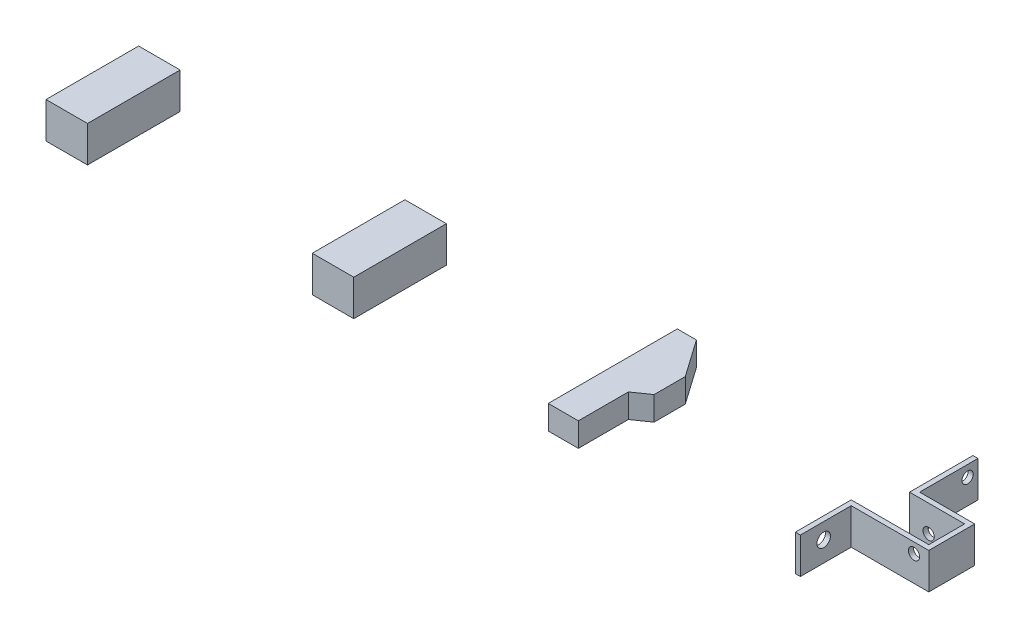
ISO-10303-21;
HEADER;
FILE_DESCRIPTION(('STEP AP214'),'2;1');
FILE_NAME('part.step','',(''),(''),'','','');
FILE_SCHEMA(('AUTOMOTIVE_DESIGN { 1 0 10303 214 1 1 1 1 }'));
ENDSEC;
DATA;
#1=APPLICATION_CONTEXT('core data for automotive mechanical design processes');
#2=APPLICATION_PROTOCOL_DEFINITION('international standard','automotive_design',2000,#1);
#3=PRODUCT_CONTEXT('',#1,'mechanical');
#4=PRODUCT('Part','Part','',(#3));
#5=PRODUCT_RELATED_PRODUCT_CATEGORY('part','',(#4));
#6=PRODUCT_DEFINITION_FORMATION('','',#4);
#7=PRODUCT_DEFINITION_CONTEXT('part definition',#1,'design');
#8=PRODUCT_DEFINITION('design','',#6,#7);
#9=PRODUCT_DEFINITION_SHAPE('','',#8);
#10=(LENGTH_UNIT() NAMED_UNIT(*) SI_UNIT(.MILLI.,.METRE.));
#11=(NAMED_UNIT(*) PLANE_ANGLE_UNIT() SI_UNIT($,.RADIAN.));
#12=(NAMED_UNIT(*) SI_UNIT($,.STERADIAN.) SOLID_ANGLE_UNIT());
#13=UNCERTAINTY_MEASURE_WITH_UNIT(LENGTH_MEASURE(1.E-05),#10,'distance_accuracy_value','');
#14=(GEOMETRIC_REPRESENTATION_CONTEXT(3) GLOBAL_UNCERTAINTY_ASSIGNED_CONTEXT((#13)) GLOBAL_UNIT_ASSIGNED_CONTEXT((#10,
#11,#12)) REPRESENTATION_CONTEXT('',''));
#15=CARTESIAN_POINT('',(0.,0.,0.));
#16=DIRECTION('',(0.,0.,1.));
#17=DIRECTION('',(1.,0.,0.));
#18=AXIS2_PLACEMENT_3D('',#15,#16,#17);
#19=CARTESIAN_POINT('',(2807.43276867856,90.932,-231.918070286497));
#20=DIRECTION('',(-1.,0.,0.));
#21=DIRECTION('',(0.,0.,1.));
#22=AXIS2_PLACEMENT_3D('',#19,#20,#21);
#23=PLANE('',#22);
#24=CARTESIAN_POINT('',(2807.43276867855,62.3904977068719,-365.992045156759));
#25=DIRECTION('',(1.,0.,0.));
#26=DIRECTION('',(0.,0.,-1.));
#27=AXIS2_PLACEMENT_3D('',#24,#25,#26);
#28=CIRCLE('',#27,14.2659387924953);
#29=CARTESIAN_POINT('',(2807.43276867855,62.3904977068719,-380.257983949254));
#30=VERTEX_POINT('',#29);
#31=EDGE_CURVE('E280',#30,#30,#28,.T.);
#32=ORIENTED_EDGE('',*,*,#31,.F.);
#33=EDGE_LOOP('',(#32));
#34=FACE_BOUND('',#33,.T.);
#35=DIRECTION('',(0.,0.,-1.));
#36=VECTOR('',#35,1.);
#37=CARTESIAN_POINT('',(2807.43276867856,0.,-231.918070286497));
#38=LINE('',#37,#36);
#39=CARTESIAN_POINT('',(2807.43276867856,0.,-244.618070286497));
#40=VERTEX_POINT('',#39);
#41=CARTESIAN_POINT('',(2807.43276867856,0.,-392.203098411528));
#42=VERTEX_POINT('',#41);
#43=EDGE_CURVE('E140',#40,#42,#38,.T.);
#44=ORIENTED_EDGE('',*,*,#43,.T.);
#45=DIRECTION('',(0.,-1.,0.));
#46=VECTOR('',#45,1.);
#47=CARTESIAN_POINT('',(2807.43276867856,90.932,-392.203098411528));
#48=LINE('',#47,#46);
#49=CARTESIAN_POINT('',(2807.43276867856,90.932,-392.203098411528));
#50=VERTEX_POINT('',#49);
#51=EDGE_CURVE('E12',#50,#42,#48,.T.);
#52=ORIENTED_EDGE('',*,*,#51,.F.);
#53=DIRECTION('',(0.,0.,-1.));
#54=VECTOR('',#53,1.);
#55=CARTESIAN_POINT('',(2807.43276867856,90.932,-231.918070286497));
#56=LINE('',#55,#54);
#57=CARTESIAN_POINT('',(2807.43276867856,90.932,-244.618070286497));
#58=VERTEX_POINT('',#57);
#59=EDGE_CURVE('E176',#58,#50,#56,.T.);
#60=ORIENTED_EDGE('',*,*,#59,.F.);
#61=DIRECTION('',(0.,-1.,0.));
#62=VECTOR('',#61,1.);
#63=CARTESIAN_POINT('',(2807.43276867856,90.932,-244.618070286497));
#64=LINE('',#63,#62);
#65=EDGE_CURVE('E141',#58,#40,#64,.T.);
#66=ORIENTED_EDGE('',*,*,#65,.T.);
#67=EDGE_LOOP('',(#44,#52,#60,#66));
#68=FACE_BOUND('',#67,.T.);
#69=ADVANCED_FACE('F42',(#34,#68),#23,.F.);
#70=CARTESIAN_POINT('',(2794.73276867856,90.932,-392.203098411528));
#71=DIRECTION('',(0.,0.,-1.));
#72=DIRECTION('',(-1.,0.,0.));
#73=AXIS2_PLACEMENT_3D('',#70,#71,#72);
#74=PLANE('',#73);
#75=DIRECTION('',(1.,0.,0.));
#76=VECTOR('',#75,1.);
#77=CARTESIAN_POINT('',(2794.73276867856,0.,-392.203098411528));
#78=LINE('',#77,#76);
#79=CARTESIAN_POINT('',(2794.73276867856,0.,-392.203098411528));
#80=VERTEX_POINT('',#79);
#81=EDGE_CURVE('E132',#80,#42,#78,.T.);
#82=ORIENTED_EDGE('',*,*,#81,.F.);
#83=DIRECTION('',(0.,-1.,0.));
#84=VECTOR('',#83,1.);
#85=CARTESIAN_POINT('',(2794.73276867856,90.932,-392.203098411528));
#86=LINE('',#85,#84);
#87=CARTESIAN_POINT('',(2794.73276867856,90.932,-392.203098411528));
#88=VERTEX_POINT('',#87);
#89=EDGE_CURVE('E49',#88,#80,#86,.T.);
#90=ORIENTED_EDGE('',*,*,#89,.F.);
#91=DIRECTION('',(1.,0.,0.));
#92=VECTOR('',#91,1.);
#93=CARTESIAN_POINT('',(2794.73276867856,90.932,-392.203098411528));
#94=LINE('',#93,#92);
#95=EDGE_CURVE('E135',#88,#50,#94,.T.);
#96=ORIENTED_EDGE('',*,*,#95,.T.);
#97=ORIENTED_EDGE('',*,*,#51,.T.);
#98=EDGE_LOOP('',(#82,#90,#96,#97));
#99=FACE_BOUND('',#98,.T.);
#100=ADVANCED_FACE('F130',(#99),#74,.T.);
#101=CARTESIAN_POINT('',(2794.73276867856,90.932,-231.918070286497));
#102=DIRECTION('',(-1.,0.,0.));
#103=DIRECTION('',(0.,0.,1.));
#104=AXIS2_PLACEMENT_3D('',#101,#102,#103);
#105=PLANE('',#104);
#106=CARTESIAN_POINT('',(2794.73276867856,62.3904977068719,-365.992045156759));
#107=DIRECTION('',(-1.,0.,0.));
#108=DIRECTION('',(0.,0.,1.));
#109=AXIS2_PLACEMENT_3D('',#106,#107,#108);
#110=CIRCLE('',#109,14.2659387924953);
#111=CARTESIAN_POINT('',(2794.73276867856,62.3904977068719,-351.726106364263));
#112=VERTEX_POINT('',#111);
#113=EDGE_CURVE('E283',#112,#112,#110,.F.);
#114=ORIENTED_EDGE('',*,*,#113,.T.);
#115=EDGE_LOOP('',(#114));
#116=FACE_BOUND('',#115,.T.);
#117=DIRECTION('',(0.,0.,-1.));
#118=VECTOR('',#117,1.);
#119=CARTESIAN_POINT('',(2794.73276867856,0.,-231.918070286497));
#120=LINE('',#119,#118);
#121=CARTESIAN_POINT('',(2794.73276867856,0.,-231.918070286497));
#122=VERTEX_POINT('',#121);
#123=EDGE_CURVE('E149',#122,#80,#120,.T.);
#124=ORIENTED_EDGE('',*,*,#123,.F.);
#125=DIRECTION('',(0.,-1.,0.));
#126=VECTOR('',#125,1.);
#127=CARTESIAN_POINT('',(2794.73276867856,90.932,-231.918070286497));
#128=LINE('',#127,#126);
#129=CARTESIAN_POINT('',(2794.73276867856,90.932,-231.918070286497));
#130=VERTEX_POINT('',#129);
#131=EDGE_CURVE('E223',#130,#122,#128,.T.);
#132=ORIENTED_EDGE('',*,*,#131,.F.);
#133=DIRECTION('',(0.,0.,-1.));
#134=VECTOR('',#133,1.);
#135=CARTESIAN_POINT('',(2794.73276867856,90.932,-231.918070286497));
#136=LINE('',#135,#134);
#137=EDGE_CURVE('E179',#130,#88,#136,.T.);
#138=ORIENTED_EDGE('',*,*,#137,.T.);
#139=ORIENTED_EDGE('',*,*,#89,.T.);
#140=EDGE_LOOP('',(#124,#132,#138,#139));
#141=FACE_BOUND('',#140,.T.);
#142=ADVANCED_FACE('F225',(#116,#141),#105,.T.);
#143=CARTESIAN_POINT('',(2933.94283778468,90.932,-231.918070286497));
#144=DIRECTION('',(0.,0.,1.));
#145=DIRECTION('',(1.,0.,0.));
#146=AXIS2_PLACEMENT_3D('',#143,#144,#145);
#147=PLANE('',#146);
#148=CARTESIAN_POINT('',(2842.96255362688,23.9493750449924,-231.918070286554));
#149=DIRECTION('',(0.,0.,1.));
#150=DIRECTION('',(1.,0.,0.));
#151=AXIS2_PLACEMENT_3D('',#148,#149,#150);
#152=CIRCLE('',#151,14.2659387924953);
#153=CARTESIAN_POINT('',(2857.22849241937,23.9493750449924,-231.918070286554));
#154=VERTEX_POINT('',#153);
#155=EDGE_CURVE('E282',#154,#154,#152,.T.);
#156=ORIENTED_EDGE('',*,*,#155,.F.);
#157=EDGE_LOOP('',(#156));
#158=FACE_BOUND('',#157,.T.);
#159=DIRECTION('',(-1.,0.,0.));
#160=VECTOR('',#159,1.);
#161=CARTESIAN_POINT('',(2933.94283778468,0.,-231.918070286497));
#162=LINE('',#161,#160);
#163=CARTESIAN_POINT('',(2933.94283778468,0.,-231.918070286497));
#164=VERTEX_POINT('',#163);
#165=EDGE_CURVE('E151',#164,#122,#162,.T.);
#166=ORIENTED_EDGE('',*,*,#165,.F.);
#167=DIRECTION('',(0.,-1.,0.));
#168=VECTOR('',#167,1.);
#169=CARTESIAN_POINT('',(2933.94283778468,90.932,-231.918070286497));
#170=LINE('',#169,#168);
#171=CARTESIAN_POINT('',(2933.94283778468,90.932,-231.918070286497));
#172=VERTEX_POINT('',#171);
#173=EDGE_CURVE('E221',#172,#164,#170,.T.);
#174=ORIENTED_EDGE('',*,*,#173,.F.);
#175=DIRECTION('',(-1.,0.,0.));
#176=VECTOR('',#175,1.);
#177=CARTESIAN_POINT('',(2933.94283778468,90.932,-231.918070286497));
#178=LINE('',#177,#176);
#179=EDGE_CURVE('E182',#172,#130,#178,.T.);
#180=ORIENTED_EDGE('',*,*,#179,.T.);
#181=ORIENTED_EDGE('',*,*,#131,.T.);
#182=EDGE_LOOP('',(#166,#174,#180,#181));
#183=FACE_BOUND('',#182,.T.);
#184=ADVANCED_FACE('F232',(#158,#183),#147,.T.);
#185=CARTESIAN_POINT('',(2933.94283778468,90.932,-141.242708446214));
#186=DIRECTION('',(-1.,0.,0.));
#187=DIRECTION('',(0.,0.,1.));
#188=AXIS2_PLACEMENT_3D('',#185,#186,#187);
#189=PLANE('',#188);
#190=DIRECTION('',(0.,0.,-1.));
#191=VECTOR('',#190,1.);
#192=CARTESIAN_POINT('',(2933.94283778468,0.,-141.242708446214));
#193=LINE('',#192,#191);
#194=CARTESIAN_POINT('',(2933.94283778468,0.,-141.242708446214));
#195=VERTEX_POINT('',#194);
#196=EDGE_CURVE('E156',#195,#164,#193,.T.);
#197=ORIENTED_EDGE('',*,*,#196,.F.);
#198=DIRECTION('',(0.,-1.,0.));
#199=VECTOR('',#198,1.);
#200=CARTESIAN_POINT('',(2933.94283778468,90.932,-141.242708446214));
#201=LINE('',#200,#199);
#202=CARTESIAN_POINT('',(2933.94283778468,90.932,-141.242708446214));
#203=VERTEX_POINT('',#202);
#204=EDGE_CURVE('E219',#203,#195,#201,.T.);
#205=ORIENTED_EDGE('',*,*,#204,.F.);
#206=DIRECTION('',(0.,0.,-1.));
#207=VECTOR('',#206,1.);
#208=CARTESIAN_POINT('',(2933.94283778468,90.932,-141.242708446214));
#209=LINE('',#208,#207);
#210=EDGE_CURVE('E185',#203,#172,#209,.T.);
#211=ORIENTED_EDGE('',*,*,#210,.T.);
#212=ORIENTED_EDGE('',*,*,#173,.T.);
#213=EDGE_LOOP('',(#197,#205,#211,#212));
#214=FACE_BOUND('',#213,.T.);
#215=ADVANCED_FACE('F235',(#214),#189,.T.);
#216=CARTESIAN_POINT('',(2737.90789771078,90.932,-141.242708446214));
#217=DIRECTION('',(0.,0.,-1.));
#218=DIRECTION('',(-1.,0.,0.));
#219=AXIS2_PLACEMENT_3D('',#216,#217,#218);
#220=PLANE('',#219);
#221=CARTESIAN_POINT('',(2909.26893038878,65.0381850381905,-141.242708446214));
#222=DIRECTION('',(0.,0.,-1.));
#223=DIRECTION('',(-1.,0.,0.));
#224=AXIS2_PLACEMENT_3D('',#221,#222,#223);
#225=CIRCLE('',#224,14.2659387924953);
#226=CARTESIAN_POINT('',(2895.00299159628,65.0381850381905,-141.242708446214));
#227=VERTEX_POINT('',#226);
#228=EDGE_CURVE('E293',#227,#227,#225,.F.);
#229=ORIENTED_EDGE('',*,*,#228,.T.);
#230=EDGE_LOOP('',(#229));
#231=FACE_BOUND('',#230,.T.);
#232=DIRECTION('',(1.,0.,0.));
#233=VECTOR('',#232,1.);
#234=CARTESIAN_POINT('',(2737.90789771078,0.,-141.242708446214));
#235=LINE('',#234,#233);
#236=CARTESIAN_POINT('',(2737.90789771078,0.,-141.242708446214));
#237=VERTEX_POINT('',#236);
#238=EDGE_CURVE('E159',#237,#195,#235,.T.);
#239=ORIENTED_EDGE('',*,*,#238,.F.);
#240=DIRECTION('',(0.,-1.,0.));
#241=VECTOR('',#240,1.);
#242=CARTESIAN_POINT('',(2737.90789771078,90.932,-141.242708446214));
#243=LINE('',#242,#241);
#244=CARTESIAN_POINT('',(2737.90789771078,90.932,-141.242708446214));
#245=VERTEX_POINT('',#244);
#246=EDGE_CURVE('E217',#245,#237,#243,.T.);
#247=ORIENTED_EDGE('',*,*,#246,.F.);
#248=DIRECTION('',(1.,0.,0.));
#249=VECTOR('',#248,1.);
#250=CARTESIAN_POINT('',(2737.90789771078,90.932,-141.242708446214));
#251=LINE('',#250,#249);
#252=EDGE_CURVE('E188',#245,#203,#251,.T.);
#253=ORIENTED_EDGE('',*,*,#252,.T.);
#254=ORIENTED_EDGE('',*,*,#204,.T.);
#255=EDGE_LOOP('',(#239,#247,#253,#254));
#256=FACE_BOUND('',#255,.T.);
#257=ADVANCED_FACE('F240',(#231,#256),#220,.T.);
#258=CARTESIAN_POINT('',(2737.90789771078,90.932,0.));
#259=DIRECTION('',(-1.,0.,0.));
#260=DIRECTION('',(0.,0.,1.));
#261=AXIS2_PLACEMENT_3D('',#258,#259,#260);
#262=PLANE('',#261);
#263=CARTESIAN_POINT('',(2737.90789771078,50.87769285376,-58.9251392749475));
#264=DIRECTION('',(-1.,0.,0.));
#265=DIRECTION('',(0.,0.,1.));
#266=AXIS2_PLACEMENT_3D('',#263,#264,#265);
#267=CIRCLE('',#266,17.1517403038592);
#268=CARTESIAN_POINT('',(2737.90789771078,50.87769285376,-41.7733989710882));
#269=VERTEX_POINT('',#268);
#270=EDGE_CURVE('E299',#269,#269,#267,.F.);
#271=ORIENTED_EDGE('',*,*,#270,.T.);
#272=EDGE_LOOP('',(#271));
#273=FACE_BOUND('',#272,.T.);
#274=DIRECTION('',(0.,0.,-1.));
#275=VECTOR('',#274,1.);
#276=CARTESIAN_POINT('',(2737.90789771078,0.,0.));
#277=LINE('',#276,#275);
#278=CARTESIAN_POINT('',(2737.90789771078,0.,0.));
#279=VERTEX_POINT('',#278);
#280=EDGE_CURVE('E162',#279,#237,#277,.T.);
#281=ORIENTED_EDGE('',*,*,#280,.F.);
#282=DIRECTION('',(0.,-1.,0.));
#283=VECTOR('',#282,1.);
#284=CARTESIAN_POINT('',(2737.90789771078,90.932,0.));
#285=LINE('',#284,#283);
#286=CARTESIAN_POINT('',(2737.90789771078,90.932,0.));
#287=VERTEX_POINT('',#286);
#288=EDGE_CURVE('E215',#287,#279,#285,.T.);
#289=ORIENTED_EDGE('',*,*,#288,.F.);
#290=DIRECTION('',(0.,0.,-1.));
#291=VECTOR('',#290,1.);
#292=CARTESIAN_POINT('',(2737.90789771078,90.932,0.));
#293=LINE('',#292,#291);
#294=EDGE_CURVE('E191',#287,#245,#293,.T.);
#295=ORIENTED_EDGE('',*,*,#294,.T.);
#296=ORIENTED_EDGE('',*,*,#246,.T.);
#297=EDGE_LOOP('',(#281,#289,#295,#296));
#298=FACE_BOUND('',#297,.T.);
#299=ADVANCED_FACE('F243',(#273,#298),#262,.T.);
#300=CARTESIAN_POINT('',(2750.60789771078,90.932,0.));
#301=DIRECTION('',(0.,0.,1.));
#302=DIRECTION('',(1.,0.,0.));
#303=AXIS2_PLACEMENT_3D('',#300,#301,#302);
#304=PLANE('',#303);
#305=DIRECTION('',(-1.,0.,0.));
#306=VECTOR('',#305,1.);
#307=CARTESIAN_POINT('',(2750.60789771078,0.,0.));
#308=LINE('',#307,#306);
#309=CARTESIAN_POINT('',(2750.60789771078,0.,0.));
#310=VERTEX_POINT('',#309);
#311=EDGE_CURVE('E165',#310,#279,#308,.T.);
#312=ORIENTED_EDGE('',*,*,#311,.F.);
#313=DIRECTION('',(0.,-1.,0.));
#314=VECTOR('',#313,1.);
#315=CARTESIAN_POINT('',(2750.60789771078,90.932,0.));
#316=LINE('',#315,#314);
#317=CARTESIAN_POINT('',(2750.60789771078,90.932,0.));
#318=VERTEX_POINT('',#317);
#319=EDGE_CURVE('E213',#318,#310,#316,.T.);
#320=ORIENTED_EDGE('',*,*,#319,.F.);
#321=DIRECTION('',(-1.,0.,0.));
#322=VECTOR('',#321,1.);
#323=CARTESIAN_POINT('',(2750.60789771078,90.932,0.));
#324=LINE('',#323,#322);
#325=EDGE_CURVE('E194',#318,#287,#324,.T.);
#326=ORIENTED_EDGE('',*,*,#325,.T.);
#327=ORIENTED_EDGE('',*,*,#288,.T.);
#328=EDGE_LOOP('',(#312,#320,#326,#327));
#329=FACE_BOUND('',#328,.T.);
#330=ADVANCED_FACE('F247',(#329),#304,.T.);
#331=CARTESIAN_POINT('',(2750.60789771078,90.932,0.));
#332=DIRECTION('',(-1.,0.,0.));
#333=DIRECTION('',(0.,0.,1.));
#334=AXIS2_PLACEMENT_3D('',#331,#332,#333);
#335=PLANE('',#334);
#336=CARTESIAN_POINT('',(2750.60789771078,50.87769285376,-58.9251392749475));
#337=DIRECTION('',(1.,0.,0.));
#338=DIRECTION('',(0.,0.,-1.));
#339=AXIS2_PLACEMENT_3D('',#336,#337,#338);
#340=CIRCLE('',#339,17.1517403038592);
#341=CARTESIAN_POINT('',(2750.60789771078,50.87769285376,-76.0768795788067));
#342=VERTEX_POINT('',#341);
#343=EDGE_CURVE('E144',#342,#342,#340,.T.);
#344=ORIENTED_EDGE('',*,*,#343,.F.);
#345=EDGE_LOOP('',(#344));
#346=FACE_BOUND('',#345,.T.);
#347=DIRECTION('',(0.,0.,-1.));
#348=VECTOR('',#347,1.);
#349=CARTESIAN_POINT('',(2750.60789771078,0.,0.));
#350=LINE('',#349,#348);
#351=CARTESIAN_POINT('',(2750.60789771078,0.,-128.542708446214));
#352=VERTEX_POINT('',#351);
#353=EDGE_CURVE('E168',#310,#352,#350,.T.);
#354=ORIENTED_EDGE('',*,*,#353,.T.);
#355=DIRECTION('',(0.,-1.,0.));
#356=VECTOR('',#355,1.);
#357=CARTESIAN_POINT('',(2750.60789771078,90.932,-128.542708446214));
#358=LINE('',#357,#356);
#359=CARTESIAN_POINT('',(2750.60789771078,90.932,-128.542708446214));
#360=VERTEX_POINT('',#359);
#361=EDGE_CURVE('E210',#360,#352,#358,.T.);
#362=ORIENTED_EDGE('',*,*,#361,.F.);
#363=DIRECTION('',(0.,0.,-1.));
#364=VECTOR('',#363,1.);
#365=CARTESIAN_POINT('',(2750.60789771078,90.932,0.));
#366=LINE('',#365,#364);
#367=EDGE_CURVE('E197',#318,#360,#366,.T.);
#368=ORIENTED_EDGE('',*,*,#367,.F.);
#369=ORIENTED_EDGE('',*,*,#319,.T.);
#370=EDGE_LOOP('',(#354,#362,#368,#369));
#371=FACE_BOUND('',#370,.T.);
#372=ADVANCED_FACE('F252',(#346,#371),#335,.F.);
#373=CARTESIAN_POINT('',(2737.90789771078,90.932,-128.542708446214));
#374=DIRECTION('',(0.,0.,-1.));
#375=DIRECTION('',(-1.,0.,0.));
#376=AXIS2_PLACEMENT_3D('',#373,#374,#375);
#377=PLANE('',#376);
#378=CARTESIAN_POINT('',(2909.26893038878,65.0381850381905,-128.542708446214));
#379=DIRECTION('',(0.,0.,1.));
#380=DIRECTION('',(1.,0.,0.));
#381=AXIS2_PLACEMENT_3D('',#378,#379,#380);
#382=CIRCLE('',#381,14.2659387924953);
#383=CARTESIAN_POINT('',(2923.53486918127,65.0381850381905,-128.542708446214));
#384=VERTEX_POINT('',#383);
#385=EDGE_CURVE('E296',#384,#384,#382,.T.);
#386=ORIENTED_EDGE('',*,*,#385,.F.);
#387=EDGE_LOOP('',(#386));
#388=FACE_BOUND('',#387,.T.);
#389=DIRECTION('',(1.,0.,0.));
#390=VECTOR('',#389,1.);
#391=CARTESIAN_POINT('',(2737.90789771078,0.,-128.542708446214));
#392=LINE('',#391,#390);
#393=CARTESIAN_POINT('',(2946.64283778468,0.,-128.542708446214));
#394=VERTEX_POINT('',#393);
#395=EDGE_CURVE('E170',#352,#394,#392,.T.);
#396=ORIENTED_EDGE('',*,*,#395,.T.);
#397=DIRECTION('',(0.,-1.,0.));
#398=VECTOR('',#397,1.);
#399=CARTESIAN_POINT('',(2946.64283778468,90.932,-128.542708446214));
#400=LINE('',#399,#398);
#401=CARTESIAN_POINT('',(2946.64283778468,90.932,-128.542708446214));
#402=VERTEX_POINT('',#401);
#403=EDGE_CURVE('E207',#402,#394,#400,.T.);
#404=ORIENTED_EDGE('',*,*,#403,.F.);
#405=DIRECTION('',(1.,0.,0.));
#406=VECTOR('',#405,1.);
#407=CARTESIAN_POINT('',(2737.90789771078,90.932,-128.542708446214));
#408=LINE('',#407,#406);
#409=EDGE_CURVE('E199',#360,#402,#408,.T.);
#410=ORIENTED_EDGE('',*,*,#409,.F.);
#411=ORIENTED_EDGE('',*,*,#361,.T.);
#412=EDGE_LOOP('',(#396,#404,#410,#411));
#413=FACE_BOUND('',#412,.T.);
#414=ADVANCED_FACE('F256',(#388,#413),#377,.F.);
#415=CARTESIAN_POINT('',(2946.64283778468,90.932,-141.242708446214));
#416=DIRECTION('',(-1.,0.,0.));
#417=DIRECTION('',(0.,0.,1.));
#418=AXIS2_PLACEMENT_3D('',#415,#416,#417);
#419=PLANE('',#418);
#420=DIRECTION('',(0.,0.,-1.));
#421=VECTOR('',#420,1.);
#422=CARTESIAN_POINT('',(2946.64283778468,0.,-141.242708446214));
#423=LINE('',#422,#421);
#424=CARTESIAN_POINT('',(2946.64283778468,0.,-244.618070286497));
#425=VERTEX_POINT('',#424);
#426=EDGE_CURVE('E172',#394,#425,#423,.T.);
#427=ORIENTED_EDGE('',*,*,#426,.T.);
#428=DIRECTION('',(0.,-1.,0.));
#429=VECTOR('',#428,1.);
#430=CARTESIAN_POINT('',(2946.64283778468,90.932,-244.618070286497));
#431=LINE('',#430,#429);
#432=CARTESIAN_POINT('',(2946.64283778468,90.932,-244.618070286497));
#433=VERTEX_POINT('',#432);
#434=EDGE_CURVE('E204',#433,#425,#431,.T.);
#435=ORIENTED_EDGE('',*,*,#434,.F.);
#436=DIRECTION('',(0.,0.,-1.));
#437=VECTOR('',#436,1.);
#438=CARTESIAN_POINT('',(2946.64283778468,90.932,-141.242708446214));
#439=LINE('',#438,#437);
#440=EDGE_CURVE('E61',#402,#433,#439,.T.);
#441=ORIENTED_EDGE('',*,*,#440,.F.);
#442=ORIENTED_EDGE('',*,*,#403,.T.);
#443=EDGE_LOOP('',(#427,#435,#441,#442));
#444=FACE_BOUND('',#443,.T.);
#445=ADVANCED_FACE('F260',(#444),#419,.F.);
#446=CARTESIAN_POINT('',(2933.94283778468,90.932,-244.618070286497));
#447=DIRECTION('',(0.,0.,1.));
#448=DIRECTION('',(1.,0.,0.));
#449=AXIS2_PLACEMENT_3D('',#446,#447,#448);
#450=PLANE('',#449);
#451=CARTESIAN_POINT('',(2842.96255362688,23.9493750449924,-244.618070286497));
#452=DIRECTION('',(0.,0.,1.));
#453=DIRECTION('',(1.,0.,0.));
#454=AXIS2_PLACEMENT_3D('',#451,#452,#453);
#455=CIRCLE('',#454,14.2659387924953);
#456=CARTESIAN_POINT('',(2857.22849241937,23.9493750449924,-244.618070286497));
#457=VERTEX_POINT('',#456);
#458=EDGE_CURVE('E286',#457,#457,#455,.F.);
#459=ORIENTED_EDGE('',*,*,#458,.F.);
#460=EDGE_LOOP('',(#459));
#461=FACE_BOUND('',#460,.T.);
#462=DIRECTION('',(1.,0.,0.));
#463=VECTOR('',#462,1.);
#464=CARTESIAN_POINT('',(2933.94283778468,0.,-244.618070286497));
#465=LINE('',#464,#463);
#466=EDGE_CURVE('E174',#425,#40,#465,.F.);
#467=ORIENTED_EDGE('',*,*,#466,.T.);
#468=ORIENTED_EDGE('',*,*,#65,.F.);
#469=DIRECTION('',(1.,0.,0.));
#470=VECTOR('',#469,1.);
#471=CARTESIAN_POINT('',(2933.94283778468,90.932,-244.618070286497));
#472=LINE('',#471,#470);
#473=EDGE_CURVE('E56',#433,#58,#472,.F.);
#474=ORIENTED_EDGE('',*,*,#473,.F.);
#475=ORIENTED_EDGE('',*,*,#434,.T.);
#476=EDGE_LOOP('',(#467,#468,#474,#475));
#477=FACE_BOUND('',#476,.T.);
#478=ADVANCED_FACE('F262',(#461,#477),#450,.F.);
#479=CARTESIAN_POINT('',(2807.43276867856,90.932,-392.203098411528));
#480=DIRECTION('',(0.,-1.,0.));
#481=DIRECTION('',(0.,0.,-1.));
#482=AXIS2_PLACEMENT_3D('',#479,#480,#481);
#483=PLANE('',#482);
#484=ORIENTED_EDGE('',*,*,#59,.T.);
#485=ORIENTED_EDGE('',*,*,#95,.F.);
#486=ORIENTED_EDGE('',*,*,#137,.F.);
#487=ORIENTED_EDGE('',*,*,#179,.F.);
#488=ORIENTED_EDGE('',*,*,#210,.F.);
#489=ORIENTED_EDGE('',*,*,#252,.F.);
#490=ORIENTED_EDGE('',*,*,#294,.F.);
#491=ORIENTED_EDGE('',*,*,#325,.F.);
#492=ORIENTED_EDGE('',*,*,#367,.T.);
#493=ORIENTED_EDGE('',*,*,#409,.T.);
#494=ORIENTED_EDGE('',*,*,#440,.T.);
#495=ORIENTED_EDGE('',*,*,#473,.T.);
#496=EDGE_LOOP('',(#484,#485,#486,#487,#488,#489,#490,#491,#492,#493,#494,#495));
#497=FACE_BOUND('',#496,.T.);
#498=ADVANCED_FACE('F227',(#497),#483,.F.);
#499=CARTESIAN_POINT('',(2807.43276867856,0.,-392.203098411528));
#500=DIRECTION('',(0.,-1.,0.));
#501=DIRECTION('',(0.,0.,-1.));
#502=AXIS2_PLACEMENT_3D('',#499,#500,#501);
#503=PLANE('',#502);
#504=ORIENTED_EDGE('',*,*,#43,.F.);
#505=ORIENTED_EDGE('',*,*,#466,.F.);
#506=ORIENTED_EDGE('',*,*,#426,.F.);
#507=ORIENTED_EDGE('',*,*,#395,.F.);
#508=ORIENTED_EDGE('',*,*,#353,.F.);
#509=ORIENTED_EDGE('',*,*,#311,.T.);
#510=ORIENTED_EDGE('',*,*,#280,.T.);
#511=ORIENTED_EDGE('',*,*,#238,.T.);
#512=ORIENTED_EDGE('',*,*,#196,.T.);
#513=ORIENTED_EDGE('',*,*,#165,.T.);
#514=ORIENTED_EDGE('',*,*,#123,.T.);
#515=ORIENTED_EDGE('',*,*,#81,.T.);
#516=EDGE_LOOP('',(#504,#505,#506,#507,#508,#509,#510,#511,#512,#513,#514,#515));
#517=FACE_BOUND('',#516,.T.);
#518=ADVANCED_FACE('F146',(#517),#503,.T.);
#519=CARTESIAN_POINT('',(843.962027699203,50.87769285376,-58.9251392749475));
#520=DIRECTION('',(1.,0.,0.));
#521=DIRECTION('',(0.,0.,-1.));
#522=AXIS2_PLACEMENT_3D('',#519,#520,#521);
#523=CYLINDRICAL_SURFACE('',#522,17.1517403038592);
#524=ORIENTED_EDGE('',*,*,#270,.F.);
#525=EDGE_LOOP('',(#524));
#526=FACE_BOUND('',#525,.T.);
#527=ORIENTED_EDGE('',*,*,#343,.T.);
#528=EDGE_LOOP('',(#527));
#529=FACE_BOUND('',#528,.T.);
#530=ADVANCED_FACE('F305',(#526,#529),#523,.F.);
#531=CARTESIAN_POINT('',(2909.26893038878,65.0381850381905,-392.204098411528));
#532=DIRECTION('',(0.,0.,1.));
#533=DIRECTION('',(1.,0.,0.));
#534=AXIS2_PLACEMENT_3D('',#531,#532,#533);
#535=CYLINDRICAL_SURFACE('',#534,14.2659387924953);
#536=ORIENTED_EDGE('',*,*,#228,.F.);
#537=EDGE_LOOP('',(#536));
#538=FACE_BOUND('',#537,.T.);
#539=ORIENTED_EDGE('',*,*,#385,.T.);
#540=EDGE_LOOP('',(#539));
#541=FACE_BOUND('',#540,.T.);
#542=ADVANCED_FACE('F308',(#538,#541),#535,.F.);
#543=CARTESIAN_POINT('',(2842.96255362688,23.9493750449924,-392.204098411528));
#544=DIRECTION('',(0.,0.,1.));
#545=DIRECTION('',(1.,0.,0.));
#546=AXIS2_PLACEMENT_3D('',#543,#544,#545);
#547=CYLINDRICAL_SURFACE('',#546,14.2659387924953);
#548=ORIENTED_EDGE('',*,*,#155,.T.);
#549=EDGE_LOOP('',(#548));
#550=FACE_BOUND('',#549,.T.);
#551=ORIENTED_EDGE('',*,*,#458,.T.);
#552=EDGE_LOOP('',(#551));
#553=FACE_BOUND('',#552,.T.);
#554=ADVANCED_FACE('F340',(#550,#553),#547,.F.);
#555=CARTESIAN_POINT('',(843.962027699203,62.3904977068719,-365.992045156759));
#556=DIRECTION('',(1.,0.,0.));
#557=DIRECTION('',(0.,0.,-1.));
#558=AXIS2_PLACEMENT_3D('',#555,#556,#557);
#559=CYLINDRICAL_SURFACE('',#558,14.2659387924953);
#560=ORIENTED_EDGE('',*,*,#113,.F.);
#561=EDGE_LOOP('',(#560));
#562=FACE_BOUND('',#561,.T.);
#563=ORIENTED_EDGE('',*,*,#31,.T.);
#564=EDGE_LOOP('',(#563));
#565=FACE_BOUND('',#564,.T.);
#566=ADVANCED_FACE('F338',(#562,#565),#559,.F.);
#567=CLOSED_SHELL('',(#69,#100,#142,#184,#215,#257,#299,#330,#372,#414,#445,#478,#498,#518,#530,
#542,#554,#566));
#568=MANIFOLD_SOLID_BREP('B2',#567);
#569=CARTESIAN_POINT('',(2189.49264517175,60.452,0.));
#570=DIRECTION('',(0.,0.,-1.));
#571=DIRECTION('',(-1.,0.,0.));
#572=AXIS2_PLACEMENT_3D('',#569,#570,#571);
#573=PLANE('',#572);
#574=DIRECTION('',(1.,0.,0.));
#575=VECTOR('',#574,1.);
#576=CARTESIAN_POINT('',(2189.49264517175,0.,0.));
#577=LINE('',#576,#575);
#578=CARTESIAN_POINT('',(2113.43173878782,0.,0.));
#579=VERTEX_POINT('',#578);
#580=CARTESIAN_POINT('',(2189.49264517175,0.,0.));
#581=VERTEX_POINT('',#580);
#582=EDGE_CURVE('E530',#579,#581,#577,.T.);
#583=ORIENTED_EDGE('',*,*,#582,.T.);
#584=DIRECTION('',(0.,-1.,0.));
#585=VECTOR('',#584,1.);
#586=CARTESIAN_POINT('',(2189.49264517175,60.452,0.));
#587=LINE('',#586,#585);
#588=CARTESIAN_POINT('',(2189.49264517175,60.452,0.));
#589=VERTEX_POINT('',#588);
#590=EDGE_CURVE('E40',#589,#581,#587,.T.);
#591=ORIENTED_EDGE('',*,*,#590,.F.);
#592=DIRECTION('',(1.,0.,0.));
#593=VECTOR('',#592,1.);
#594=CARTESIAN_POINT('',(2189.49264517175,60.452,0.));
#595=LINE('',#594,#593);
#596=CARTESIAN_POINT('',(2113.43173878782,60.452,0.));
#597=VERTEX_POINT('',#596);
#598=EDGE_CURVE('E555',#597,#589,#595,.T.);
#599=ORIENTED_EDGE('',*,*,#598,.F.);
#600=DIRECTION('',(0.,-1.,0.));
#601=VECTOR('',#600,1.);
#602=CARTESIAN_POINT('',(2113.43173878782,60.452,0.));
#603=LINE('',#602,#601);
#604=EDGE_CURVE('E543',#597,#579,#603,.T.);
#605=ORIENTED_EDGE('',*,*,#604,.T.);
#606=EDGE_LOOP('',(#583,#591,#599,#605));
#607=FACE_BOUND('',#606,.T.);
#608=ADVANCED_FACE('F468',(#607),#573,.F.);
#609=CARTESIAN_POINT('',(2189.49264517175,60.452,-126.316828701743));
#610=DIRECTION('',(-1.,0.,0.));
#611=DIRECTION('',(0.,0.,1.));
#612=AXIS2_PLACEMENT_3D('',#609,#610,#611);
#613=PLANE('',#612);
#614=DIRECTION('',(0.,0.,-1.));
#615=VECTOR('',#614,1.);
#616=CARTESIAN_POINT('',(2189.49264517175,0.,-126.316828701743));
#617=LINE('',#616,#615);
#618=CARTESIAN_POINT('',(2189.49264517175,0.,-126.316828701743));
#619=VERTEX_POINT('',#618);
#620=EDGE_CURVE('E526',#581,#619,#617,.T.);
#621=ORIENTED_EDGE('',*,*,#620,.T.);
#622=DIRECTION('',(0.,-1.,0.));
#623=VECTOR('',#622,1.);
#624=CARTESIAN_POINT('',(2189.49264517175,60.452,-126.316828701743));
#625=LINE('',#624,#623);
#626=CARTESIAN_POINT('',(2189.49264517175,60.452,-126.316828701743));
#627=VERTEX_POINT('',#626);
#628=EDGE_CURVE('E475',#627,#619,#625,.T.);
#629=ORIENTED_EDGE('',*,*,#628,.F.);
#630=DIRECTION('',(0.,0.,-1.));
#631=VECTOR('',#630,1.);
#632=CARTESIAN_POINT('',(2189.49264517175,60.452,-126.316828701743));
#633=LINE('',#632,#631);
#634=EDGE_CURVE('E539',#589,#627,#633,.T.);
#635=ORIENTED_EDGE('',*,*,#634,.F.);
#636=ORIENTED_EDGE('',*,*,#590,.T.);
#637=EDGE_LOOP('',(#621,#629,#635,#636));
#638=FACE_BOUND('',#637,.T.);
#639=ADVANCED_FACE('F538',(#638),#613,.F.);
#640=CARTESIAN_POINT('',(2227.78006702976,60.452,-153.142421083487));
#641=DIRECTION('',(-0.573812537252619,0.,-0.818986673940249));
#642=DIRECTION('',(-0.818986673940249,0.,0.573812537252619));
#643=AXIS2_PLACEMENT_3D('',#640,#641,#642);
#644=PLANE('',#643);
#645=DIRECTION('',(0.818986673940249,0.,-0.573812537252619));
#646=VECTOR('',#645,1.);
#647=CARTESIAN_POINT('',(2227.78006702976,0.,-153.142421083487));
#648=LINE('',#647,#646);
#649=CARTESIAN_POINT('',(2227.78006702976,0.,-153.142421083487));
#650=VERTEX_POINT('',#649);
#651=EDGE_CURVE('E532',#619,#650,#648,.T.);
#652=ORIENTED_EDGE('',*,*,#651,.T.);
#653=DIRECTION('',(0.,-1.,0.));
#654=VECTOR('',#653,1.);
#655=CARTESIAN_POINT('',(2227.78006702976,60.452,-153.142421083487));
#656=LINE('',#655,#654);
#657=CARTESIAN_POINT('',(2227.78006702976,60.452,-153.142421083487));
#658=VERTEX_POINT('',#657);
#659=EDGE_CURVE('E576',#658,#650,#656,.T.);
#660=ORIENTED_EDGE('',*,*,#659,.F.);
#661=DIRECTION('',(0.818986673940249,0.,-0.573812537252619));
#662=VECTOR('',#661,1.);
#663=CARTESIAN_POINT('',(2227.78006702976,60.452,-153.142421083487));
#664=LINE('',#663,#662);
#665=EDGE_CURVE('E558',#627,#658,#664,.T.);
#666=ORIENTED_EDGE('',*,*,#665,.F.);
#667=ORIENTED_EDGE('',*,*,#628,.T.);
#668=EDGE_LOOP('',(#652,#660,#666,#667));
#669=FACE_BOUND('',#668,.T.);
#670=ADVANCED_FACE('F580',(#669),#644,.F.);
#671=CARTESIAN_POINT('',(2227.78006702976,60.452,-231.982473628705));
#672=DIRECTION('',(-1.,0.,0.));
#673=DIRECTION('',(0.,0.,1.));
#674=AXIS2_PLACEMENT_3D('',#671,#672,#673);
#675=PLANE('',#674);
#676=DIRECTION('',(0.,0.,-1.));
#677=VECTOR('',#676,1.);
#678=CARTESIAN_POINT('',(2227.78006702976,0.,-231.982473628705));
#679=LINE('',#678,#677);
#680=CARTESIAN_POINT('',(2227.78006702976,0.,-231.982473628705));
#681=VERTEX_POINT('',#680);
#682=EDGE_CURVE('E547',#650,#681,#679,.T.);
#683=ORIENTED_EDGE('',*,*,#682,.T.);
#684=DIRECTION('',(0.,-1.,0.));
#685=VECTOR('',#684,1.);
#686=CARTESIAN_POINT('',(2227.78006702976,60.452,-231.982473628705));
#687=LINE('',#686,#685);
#688=CARTESIAN_POINT('',(2227.78006702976,60.452,-231.982473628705));
#689=VERTEX_POINT('',#688);
#690=EDGE_CURVE('E573',#689,#681,#687,.T.);
#691=ORIENTED_EDGE('',*,*,#690,.F.);
#692=DIRECTION('',(0.,0.,-1.));
#693=VECTOR('',#692,1.);
#694=CARTESIAN_POINT('',(2227.78006702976,60.452,-231.982473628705));
#695=LINE('',#694,#693);
#696=EDGE_CURVE('E560',#658,#689,#695,.T.);
#697=ORIENTED_EDGE('',*,*,#696,.F.);
#698=ORIENTED_EDGE('',*,*,#659,.T.);
#699=EDGE_LOOP('',(#683,#691,#697,#698));
#700=FACE_BOUND('',#699,.T.);
#701=ADVANCED_FACE('F588',(#700),#675,.F.);
#702=CARTESIAN_POINT('',(2161.80449092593,60.452,-326.147578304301));
#703=DIRECTION('',(-0.818986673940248,0.,0.57381253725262));
#704=DIRECTION('',(0.57381253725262,0.,0.818986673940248));
#705=AXIS2_PLACEMENT_3D('',#702,#703,#704);
#706=PLANE('',#705);
#707=DIRECTION('',(-0.57381253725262,0.,-0.818986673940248));
#708=VECTOR('',#707,1.);
#709=CARTESIAN_POINT('',(2161.80449092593,0.,-326.147578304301));
#710=LINE('',#709,#708);
#711=CARTESIAN_POINT('',(2161.80449092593,0.,-326.147578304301));
#712=VERTEX_POINT('',#711);
#713=EDGE_CURVE('E549',#681,#712,#710,.T.);
#714=ORIENTED_EDGE('',*,*,#713,.T.);
#715=DIRECTION('',(0.,-1.,0.));
#716=VECTOR('',#715,1.);
#717=CARTESIAN_POINT('',(2161.80449092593,60.452,-326.147578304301));
#718=LINE('',#717,#716);
#719=CARTESIAN_POINT('',(2161.80449092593,60.452,-326.147578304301));
#720=VERTEX_POINT('',#719);
#721=EDGE_CURVE('E570',#720,#712,#718,.T.);
#722=ORIENTED_EDGE('',*,*,#721,.F.);
#723=DIRECTION('',(-0.57381253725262,0.,-0.818986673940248));
#724=VECTOR('',#723,1.);
#725=CARTESIAN_POINT('',(2161.80449092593,60.452,-326.147578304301));
#726=LINE('',#725,#724);
#727=EDGE_CURVE('E562',#689,#720,#726,.T.);
#728=ORIENTED_EDGE('',*,*,#727,.F.);
#729=ORIENTED_EDGE('',*,*,#690,.T.);
#730=EDGE_LOOP('',(#714,#722,#728,#729));
#731=FACE_BOUND('',#730,.T.);
#732=ADVANCED_FACE('F591',(#731),#706,.F.);
#733=CARTESIAN_POINT('',(2113.43173878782,60.452,-326.147578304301));
#734=DIRECTION('',(0.,0.,1.));
#735=DIRECTION('',(1.,0.,0.));
#736=AXIS2_PLACEMENT_3D('',#733,#734,#735);
#737=PLANE('',#736);
#738=DIRECTION('',(-1.,0.,0.));
#739=VECTOR('',#738,1.);
#740=CARTESIAN_POINT('',(2113.43173878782,0.,-326.147578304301));
#741=LINE('',#740,#739);
#742=CARTESIAN_POINT('',(2113.43173878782,0.,-326.147578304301));
#743=VERTEX_POINT('',#742);
#744=EDGE_CURVE('E551',#712,#743,#741,.T.);
#745=ORIENTED_EDGE('',*,*,#744,.T.);
#746=DIRECTION('',(0.,-1.,0.));
#747=VECTOR('',#746,1.);
#748=CARTESIAN_POINT('',(2113.43173878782,60.452,-326.147578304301));
#749=LINE('',#748,#747);
#750=CARTESIAN_POINT('',(2113.43173878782,60.452,-326.147578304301));
#751=VERTEX_POINT('',#750);
#752=EDGE_CURVE('E567',#751,#743,#749,.T.);
#753=ORIENTED_EDGE('',*,*,#752,.F.);
#754=DIRECTION('',(-1.,0.,0.));
#755=VECTOR('',#754,1.);
#756=CARTESIAN_POINT('',(2113.43173878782,60.452,-326.147578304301));
#757=LINE('',#756,#755);
#758=EDGE_CURVE('E487',#720,#751,#757,.T.);
#759=ORIENTED_EDGE('',*,*,#758,.F.);
#760=ORIENTED_EDGE('',*,*,#721,.T.);
#761=EDGE_LOOP('',(#745,#753,#759,#760));
#762=FACE_BOUND('',#761,.T.);
#763=ADVANCED_FACE('F594',(#762),#737,.F.);
#764=CARTESIAN_POINT('',(2113.43173878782,60.452,0.));
#765=DIRECTION('',(1.,0.,0.));
#766=DIRECTION('',(0.,0.,-1.));
#767=AXIS2_PLACEMENT_3D('',#764,#765,#766);
#768=PLANE('',#767);
#769=DIRECTION('',(0.,0.,1.));
#770=VECTOR('',#769,1.);
#771=CARTESIAN_POINT('',(2113.43173878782,0.,0.));
#772=LINE('',#771,#770);
#773=EDGE_CURVE('E553',#743,#579,#772,.T.);
#774=ORIENTED_EDGE('',*,*,#773,.T.);
#775=ORIENTED_EDGE('',*,*,#604,.F.);
#776=DIRECTION('',(0.,0.,1.));
#777=VECTOR('',#776,1.);
#778=CARTESIAN_POINT('',(2113.43173878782,60.452,0.));
#779=LINE('',#778,#777);
#780=EDGE_CURVE('E482',#751,#597,#779,.T.);
#781=ORIENTED_EDGE('',*,*,#780,.F.);
#782=ORIENTED_EDGE('',*,*,#752,.T.);
#783=EDGE_LOOP('',(#774,#775,#781,#782));
#784=FACE_BOUND('',#783,.T.);
#785=ADVANCED_FACE('F596',(#784),#768,.F.);
#786=CARTESIAN_POINT('',(2113.43173878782,60.452,0.));
#787=DIRECTION('',(0.,-1.,0.));
#788=DIRECTION('',(0.,0.,-1.));
#789=AXIS2_PLACEMENT_3D('',#786,#787,#788);
#790=PLANE('',#789);
#791=ORIENTED_EDGE('',*,*,#598,.T.);
#792=ORIENTED_EDGE('',*,*,#634,.T.);
#793=ORIENTED_EDGE('',*,*,#665,.T.);
#794=ORIENTED_EDGE('',*,*,#696,.T.);
#795=ORIENTED_EDGE('',*,*,#727,.T.);
#796=ORIENTED_EDGE('',*,*,#758,.T.);
#797=ORIENTED_EDGE('',*,*,#780,.T.);
#798=EDGE_LOOP('',(#791,#792,#793,#794,#795,#796,#797));
#799=FACE_BOUND('',#798,.T.);
#800=ADVANCED_FACE('F583',(#799),#790,.F.);
#801=CARTESIAN_POINT('',(2113.43173878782,0.,0.));
#802=DIRECTION('',(0.,-1.,0.));
#803=DIRECTION('',(0.,0.,-1.));
#804=AXIS2_PLACEMENT_3D('',#801,#802,#803);
#805=PLANE('',#804);
#806=ORIENTED_EDGE('',*,*,#582,.F.);
#807=ORIENTED_EDGE('',*,*,#773,.F.);
#808=ORIENTED_EDGE('',*,*,#744,.F.);
#809=ORIENTED_EDGE('',*,*,#713,.F.);
#810=ORIENTED_EDGE('',*,*,#682,.F.);
#811=ORIENTED_EDGE('',*,*,#651,.F.);
#812=ORIENTED_EDGE('',*,*,#620,.F.);
#813=EDGE_LOOP('',(#806,#807,#808,#809,#810,#811,#812));
#814=FACE_BOUND('',#813,.T.);
#815=ADVANCED_FACE('F527',(#814),#805,.T.);
#816=CLOSED_SHELL('',(#608,#639,#670,#701,#732,#763,#785,#800,#815));
#817=MANIFOLD_SOLID_BREP('B6',#816);
#818=CARTESIAN_POINT('',(1516.94757110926,90.932,0.));
#819=DIRECTION('',(1.,0.,0.));
#820=DIRECTION('',(0.,0.,-1.));
#821=AXIS2_PLACEMENT_3D('',#818,#819,#820);
#822=PLANE('',#821);
#823=DIRECTION('',(0.,0.,1.));
#824=VECTOR('',#823,1.);
#825=CARTESIAN_POINT('',(1516.94757110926,0.,0.));
#826=LINE('',#825,#824);
#827=CARTESIAN_POINT('',(1516.94757110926,0.,-234.156165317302));
#828=VERTEX_POINT('',#827);
#829=CARTESIAN_POINT('',(1516.94757110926,0.,0.));
#830=VERTEX_POINT('',#829);
#831=EDGE_CURVE('E723',#828,#830,#826,.T.);
#832=ORIENTED_EDGE('',*,*,#831,.T.);
#833=DIRECTION('',(0.,-1.,0.));
#834=VECTOR('',#833,1.);
#835=CARTESIAN_POINT('',(1516.94757110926,90.932,0.));
#836=LINE('',#835,#834);
#837=CARTESIAN_POINT('',(1516.94757110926,90.932,0.));
#838=VERTEX_POINT('',#837);
#839=EDGE_CURVE('E466',#838,#830,#836,.T.);
#840=ORIENTED_EDGE('',*,*,#839,.F.);
#841=DIRECTION('',(0.,0.,1.));
#842=VECTOR('',#841,1.);
#843=CARTESIAN_POINT('',(1516.94757110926,90.932,0.));
#844=LINE('',#843,#842);
#845=CARTESIAN_POINT('',(1516.94757110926,90.932,-234.156165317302));
#846=VERTEX_POINT('',#845);
#847=EDGE_CURVE('E741',#846,#838,#844,.T.);
#848=ORIENTED_EDGE('',*,*,#847,.F.);
#849=DIRECTION('',(0.,-1.,0.));
#850=VECTOR('',#849,1.);
#851=CARTESIAN_POINT('',(1516.94757110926,90.932,-234.156165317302));
#852=LINE('',#851,#850);
#853=EDGE_CURVE('E735',#846,#828,#852,.T.);
#854=ORIENTED_EDGE('',*,*,#853,.T.);
#855=EDGE_LOOP('',(#832,#840,#848,#854));
#856=FACE_BOUND('',#855,.T.);
#857=ADVANCED_FACE('F679',(#856),#822,.F.);
#858=CARTESIAN_POINT('',(1516.94757110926,90.932,0.));
#859=DIRECTION('',(0.,0.,-1.));
#860=DIRECTION('',(-1.,0.,0.));
#861=AXIS2_PLACEMENT_3D('',#858,#859,#860);
#862=PLANE('',#861);
#863=DIRECTION('',(1.,0.,0.));
#864=VECTOR('',#863,1.);
#865=CARTESIAN_POINT('',(1516.94757110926,0.,0.));
#866=LINE('',#865,#864);
#867=CARTESIAN_POINT('',(1621.80794094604,0.,0.));
#868=VERTEX_POINT('',#867);
#869=EDGE_CURVE('E719',#830,#868,#866,.T.);
#870=ORIENTED_EDGE('',*,*,#869,.T.);
#871=DIRECTION('',(0.,-1.,0.));
#872=VECTOR('',#871,1.);
#873=CARTESIAN_POINT('',(1621.80794094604,90.932,0.));
#874=LINE('',#873,#872);
#875=CARTESIAN_POINT('',(1621.80794094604,90.932,0.));
#876=VERTEX_POINT('',#875);
#877=EDGE_CURVE('E686',#876,#868,#874,.T.);
#878=ORIENTED_EDGE('',*,*,#877,.F.);
#879=DIRECTION('',(1.,0.,0.));
#880=VECTOR('',#879,1.);
#881=CARTESIAN_POINT('',(1516.94757110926,90.932,0.));
#882=LINE('',#881,#880);
#883=EDGE_CURVE('E731',#838,#876,#882,.T.);
#884=ORIENTED_EDGE('',*,*,#883,.F.);
#885=ORIENTED_EDGE('',*,*,#839,.T.);
#886=EDGE_LOOP('',(#870,#878,#884,#885));
#887=FACE_BOUND('',#886,.T.);
#888=ADVANCED_FACE('F730',(#887),#862,.F.);
#889=CARTESIAN_POINT('',(1621.80794094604,90.932,0.));
#890=DIRECTION('',(-1.,0.,0.));
#891=DIRECTION('',(0.,0.,1.));
#892=AXIS2_PLACEMENT_3D('',#889,#890,#891);
#893=PLANE('',#892);
#894=DIRECTION('',(0.,0.,-1.));
#895=VECTOR('',#894,1.);
#896=CARTESIAN_POINT('',(1621.80794094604,0.,0.));
#897=LINE('',#896,#895);
#898=CARTESIAN_POINT('',(1621.80794094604,0.,-234.156165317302));
#899=VERTEX_POINT('',#898);
#900=EDGE_CURVE('E724',#868,#899,#897,.T.);
#901=ORIENTED_EDGE('',*,*,#900,.T.);
#902=DIRECTION('',(0.,-1.,0.));
#903=VECTOR('',#902,1.);
#904=CARTESIAN_POINT('',(1621.80794094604,90.932,-234.156165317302));
#905=LINE('',#904,#903);
#906=CARTESIAN_POINT('',(1621.80794094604,90.932,-234.156165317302));
#907=VERTEX_POINT('',#906);
#908=EDGE_CURVE('E747',#907,#899,#905,.T.);
#909=ORIENTED_EDGE('',*,*,#908,.F.);
#910=DIRECTION('',(0.,0.,-1.));
#911=VECTOR('',#910,1.);
#912=CARTESIAN_POINT('',(1621.80794094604,90.932,0.));
#913=LINE('',#912,#911);
#914=EDGE_CURVE('E698',#876,#907,#913,.T.);
#915=ORIENTED_EDGE('',*,*,#914,.F.);
#916=ORIENTED_EDGE('',*,*,#877,.T.);
#917=EDGE_LOOP('',(#901,#909,#915,#916));
#918=FACE_BOUND('',#917,.T.);
#919=ADVANCED_FACE('F750',(#918),#893,.F.);
#920=CARTESIAN_POINT('',(1516.94757110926,90.932,-234.156165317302));
#921=DIRECTION('',(0.,0.,1.));
#922=DIRECTION('',(1.,0.,0.));
#923=AXIS2_PLACEMENT_3D('',#920,#921,#922);
#924=PLANE('',#923);
#925=DIRECTION('',(-1.,0.,0.));
#926=VECTOR('',#925,1.);
#927=CARTESIAN_POINT('',(1516.94757110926,0.,-234.156165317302));
#928=LINE('',#927,#926);
#929=EDGE_CURVE('E739',#899,#828,#928,.T.);
#930=ORIENTED_EDGE('',*,*,#929,.T.);
#931=ORIENTED_EDGE('',*,*,#853,.F.);
#932=DIRECTION('',(-1.,0.,0.));
#933=VECTOR('',#932,1.);
#934=CARTESIAN_POINT('',(1516.94757110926,90.932,-234.156165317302));
#935=LINE('',#934,#933);
#936=EDGE_CURVE('E693',#907,#846,#935,.T.);
#937=ORIENTED_EDGE('',*,*,#936,.F.);
#938=ORIENTED_EDGE('',*,*,#908,.T.);
#939=EDGE_LOOP('',(#930,#931,#937,#938));
#940=FACE_BOUND('',#939,.T.);
#941=ADVANCED_FACE('F752',(#940),#924,.F.);
#942=CARTESIAN_POINT('',(1516.94757110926,90.932,-234.156165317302));
#943=DIRECTION('',(0.,-1.,0.));
#944=DIRECTION('',(0.,0.,-1.));
#945=AXIS2_PLACEMENT_3D('',#942,#943,#944);
#946=PLANE('',#945);
#947=ORIENTED_EDGE('',*,*,#847,.T.);
#948=ORIENTED_EDGE('',*,*,#883,.T.);
#949=ORIENTED_EDGE('',*,*,#914,.T.);
#950=ORIENTED_EDGE('',*,*,#936,.T.);
#951=EDGE_LOOP('',(#947,#948,#949,#950));
#952=FACE_BOUND('',#951,.T.);
#953=ADVANCED_FACE('F753',(#952),#946,.F.);
#954=CARTESIAN_POINT('',(1516.94757110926,0.,-234.156165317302));
#955=DIRECTION('',(0.,-1.,0.));
#956=DIRECTION('',(0.,0.,-1.));
#957=AXIS2_PLACEMENT_3D('',#954,#955,#956);
#958=PLANE('',#957);
#959=ORIENTED_EDGE('',*,*,#831,.F.);
#960=ORIENTED_EDGE('',*,*,#929,.F.);
#961=ORIENTED_EDGE('',*,*,#900,.F.);
#962=ORIENTED_EDGE('',*,*,#869,.F.);
#963=EDGE_LOOP('',(#959,#960,#961,#962));
#964=FACE_BOUND('',#963,.T.);
#965=ADVANCED_FACE('F720',(#964),#958,.T.);
#966=CLOSED_SHELL('',(#857,#888,#919,#941,#953,#965));
#967=MANIFOLD_SOLID_BREP('B34',#966);
#968=CARTESIAN_POINT('',(843.963027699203,90.932,0.));
#969=DIRECTION('',(1.,0.,0.));
#970=DIRECTION('',(0.,0.,-1.));
#971=AXIS2_PLACEMENT_3D('',#968,#969,#970);
#972=PLANE('',#971);
#973=DIRECTION('',(0.,0.,1.));
#974=VECTOR('',#973,1.);
#975=CARTESIAN_POINT('',(843.963027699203,0.,0.));
#976=LINE('',#975,#974);
#977=CARTESIAN_POINT('',(843.963027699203,0.,-234.156165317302));
#978=VERTEX_POINT('',#977);
#979=CARTESIAN_POINT('',(843.963027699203,0.,0.));
#980=VERTEX_POINT('',#979);
#981=EDGE_CURVE('E847',#978,#980,#976,.T.);
#982=ORIENTED_EDGE('',*,*,#981,.T.);
#983=DIRECTION('',(0.,-1.,0.));
#984=VECTOR('',#983,1.);
#985=CARTESIAN_POINT('',(843.963027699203,90.932,0.));
#986=LINE('',#985,#984);
#987=CARTESIAN_POINT('',(843.963027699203,90.932,0.));
#988=VERTEX_POINT('',#987);
#989=EDGE_CURVE('E677',#988,#980,#986,.T.);
#990=ORIENTED_EDGE('',*,*,#989,.F.);
#991=DIRECTION('',(0.,0.,1.));
#992=VECTOR('',#991,1.);
#993=CARTESIAN_POINT('',(843.963027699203,90.932,0.));
#994=LINE('',#993,#992);
#995=CARTESIAN_POINT('',(843.963027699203,90.932,-234.156165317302));
#996=VERTEX_POINT('',#995);
#997=EDGE_CURVE('E865',#996,#988,#994,.T.);
#998=ORIENTED_EDGE('',*,*,#997,.F.);
#999=DIRECTION('',(0.,-1.,0.));
#1000=VECTOR('',#999,1.);
#1001=CARTESIAN_POINT('',(843.963027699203,90.932,-234.156165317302));
#1002=LINE('',#1001,#1000);
#1003=EDGE_CURVE('E859',#996,#978,#1002,.T.);
#1004=ORIENTED_EDGE('',*,*,#1003,.T.);
#1005=EDGE_LOOP('',(#982,#990,#998,#1004));
#1006=FACE_BOUND('',#1005,.T.);
#1007=ADVANCED_FACE('F803',(#1006),#972,.F.);
#1008=CARTESIAN_POINT('',(843.963027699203,90.932,0.));
#1009=DIRECTION('',(0.,0.,-1.));
#1010=DIRECTION('',(-1.,0.,0.));
#1011=AXIS2_PLACEMENT_3D('',#1008,#1009,#1010);
#1012=PLANE('',#1011);
#1013=DIRECTION('',(1.,0.,0.));
#1014=VECTOR('',#1013,1.);
#1015=CARTESIAN_POINT('',(843.963027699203,0.,0.));
#1016=LINE('',#1015,#1014);
#1017=CARTESIAN_POINT('',(948.823397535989,0.,0.));
#1018=VERTEX_POINT('',#1017);
#1019=EDGE_CURVE('E843',#980,#1018,#1016,.T.);
#1020=ORIENTED_EDGE('',*,*,#1019,.T.);
#1021=DIRECTION('',(0.,-1.,0.));
#1022=VECTOR('',#1021,1.);
#1023=CARTESIAN_POINT('',(948.823397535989,90.932,0.));
#1024=LINE('',#1023,#1022);
#1025=CARTESIAN_POINT('',(948.823397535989,90.932,0.));
#1026=VERTEX_POINT('',#1025);
#1027=EDGE_CURVE('E810',#1026,#1018,#1024,.T.);
#1028=ORIENTED_EDGE('',*,*,#1027,.F.);
#1029=DIRECTION('',(1.,0.,0.));
#1030=VECTOR('',#1029,1.);
#1031=CARTESIAN_POINT('',(843.963027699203,90.932,0.));
#1032=LINE('',#1031,#1030);
#1033=EDGE_CURVE('E855',#988,#1026,#1032,.T.);
#1034=ORIENTED_EDGE('',*,*,#1033,.F.);
#1035=ORIENTED_EDGE('',*,*,#989,.T.);
#1036=EDGE_LOOP('',(#1020,#1028,#1034,#1035));
#1037=FACE_BOUND('',#1036,.T.);
#1038=ADVANCED_FACE('F854',(#1037),#1012,.F.);
#1039=CARTESIAN_POINT('',(948.823397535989,90.932,0.));
#1040=DIRECTION('',(-1.,0.,0.));
#1041=DIRECTION('',(0.,0.,1.));
#1042=AXIS2_PLACEMENT_3D('',#1039,#1040,#1041);
#1043=PLANE('',#1042);
#1044=DIRECTION('',(0.,0.,-1.));
#1045=VECTOR('',#1044,1.);
#1046=CARTESIAN_POINT('',(948.823397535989,0.,0.));
#1047=LINE('',#1046,#1045);
#1048=CARTESIAN_POINT('',(948.823397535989,0.,-234.156165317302));
#1049=VERTEX_POINT('',#1048);
#1050=EDGE_CURVE('E848',#1018,#1049,#1047,.T.);
#1051=ORIENTED_EDGE('',*,*,#1050,.T.);
#1052=DIRECTION('',(0.,-1.,0.));
#1053=VECTOR('',#1052,1.);
#1054=CARTESIAN_POINT('',(948.823397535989,90.932,-234.156165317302));
#1055=LINE('',#1054,#1053);
#1056=CARTESIAN_POINT('',(948.823397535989,90.932,-234.156165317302));
#1057=VERTEX_POINT('',#1056);
#1058=EDGE_CURVE('E871',#1057,#1049,#1055,.T.);
#1059=ORIENTED_EDGE('',*,*,#1058,.F.);
#1060=DIRECTION('',(0.,0.,-1.));
#1061=VECTOR('',#1060,1.);
#1062=CARTESIAN_POINT('',(948.823397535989,90.932,0.));
#1063=LINE('',#1062,#1061);
#1064=EDGE_CURVE('E822',#1026,#1057,#1063,.T.);
#1065=ORIENTED_EDGE('',*,*,#1064,.F.);
#1066=ORIENTED_EDGE('',*,*,#1027,.T.);
#1067=EDGE_LOOP('',(#1051,#1059,#1065,#1066));
#1068=FACE_BOUND('',#1067,.T.);
#1069=ADVANCED_FACE('F874',(#1068),#1043,.F.);
#1070=CARTESIAN_POINT('',(843.963027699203,90.932,-234.156165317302));
#1071=DIRECTION('',(0.,0.,1.));
#1072=DIRECTION('',(1.,0.,0.));
#1073=AXIS2_PLACEMENT_3D('',#1070,#1071,#1072);
#1074=PLANE('',#1073);
#1075=DIRECTION('',(-1.,0.,0.));
#1076=VECTOR('',#1075,1.);
#1077=CARTESIAN_POINT('',(843.963027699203,0.,-234.156165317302));
#1078=LINE('',#1077,#1076);
#1079=EDGE_CURVE('E863',#1049,#978,#1078,.T.);
#1080=ORIENTED_EDGE('',*,*,#1079,.T.);
#1081=ORIENTED_EDGE('',*,*,#1003,.F.);
#1082=DIRECTION('',(-1.,0.,0.));
#1083=VECTOR('',#1082,1.);
#1084=CARTESIAN_POINT('',(843.963027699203,90.932,-234.156165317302));
#1085=LINE('',#1084,#1083);
#1086=EDGE_CURVE('E817',#1057,#996,#1085,.T.);
#1087=ORIENTED_EDGE('',*,*,#1086,.F.);
#1088=ORIENTED_EDGE('',*,*,#1058,.T.);
#1089=EDGE_LOOP('',(#1080,#1081,#1087,#1088));
#1090=FACE_BOUND('',#1089,.T.);
#1091=ADVANCED_FACE('F876',(#1090),#1074,.F.);
#1092=CARTESIAN_POINT('',(843.963027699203,90.932,-234.156165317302));
#1093=DIRECTION('',(0.,-1.,0.));
#1094=DIRECTION('',(0.,0.,-1.));
#1095=AXIS2_PLACEMENT_3D('',#1092,#1093,#1094);
#1096=PLANE('',#1095);
#1097=ORIENTED_EDGE('',*,*,#997,.T.);
#1098=ORIENTED_EDGE('',*,*,#1033,.T.);
#1099=ORIENTED_EDGE('',*,*,#1064,.T.);
#1100=ORIENTED_EDGE('',*,*,#1086,.T.);
#1101=EDGE_LOOP('',(#1097,#1098,#1099,#1100));
#1102=FACE_BOUND('',#1101,.T.);
#1103=ADVANCED_FACE('F877',(#1102),#1096,.F.);
#1104=CARTESIAN_POINT('',(843.963027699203,0.,-234.156165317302));
#1105=DIRECTION('',(0.,-1.,0.));
#1106=DIRECTION('',(0.,0.,-1.));
#1107=AXIS2_PLACEMENT_3D('',#1104,#1105,#1106);
#1108=PLANE('',#1107);
#1109=ORIENTED_EDGE('',*,*,#981,.F.);
#1110=ORIENTED_EDGE('',*,*,#1079,.F.);
#1111=ORIENTED_EDGE('',*,*,#1050,.F.);
#1112=ORIENTED_EDGE('',*,*,#1019,.F.);
#1113=EDGE_LOOP('',(#1109,#1110,#1111,#1112));
#1114=FACE_BOUND('',#1113,.T.);
#1115=ADVANCED_FACE('F844',(#1114),#1108,.T.);
#1116=CLOSED_SHELL('',(#1007,#1038,#1069,#1091,#1103,#1115));
#1117=MANIFOLD_SOLID_BREP('B460',#1116);
#1118=ADVANCED_BREP_SHAPE_REPRESENTATION('',(#18,#568,#817,#967,#1117),#14);
#1119=SHAPE_DEFINITION_REPRESENTATION(#9,#1118);
ENDSEC;
END-ISO-10303-21;
